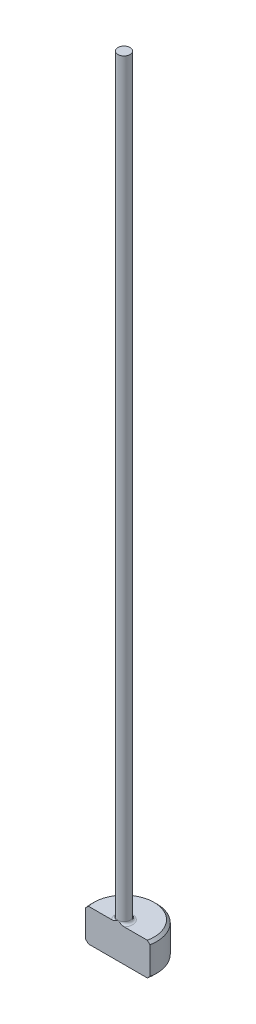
ISO-10303-21;
HEADER;
FILE_DESCRIPTION(('STEP AP214'),'2;1');
FILE_NAME('part.step','',(''),(''),'','','');
FILE_SCHEMA(('AUTOMOTIVE_DESIGN { 1 0 10303 214 1 1 1 1 }'));
ENDSEC;
DATA;
#1=APPLICATION_CONTEXT('core data for automotive mechanical design processes');
#2=APPLICATION_PROTOCOL_DEFINITION('international standard','automotive_design',2000,#1);
#3=PRODUCT_CONTEXT('',#1,'mechanical');
#4=PRODUCT('Part','Part','',(#3));
#5=PRODUCT_RELATED_PRODUCT_CATEGORY('part','',(#4));
#6=PRODUCT_DEFINITION_FORMATION('','',#4);
#7=PRODUCT_DEFINITION_CONTEXT('part definition',#1,'design');
#8=PRODUCT_DEFINITION('design','',#6,#7);
#9=PRODUCT_DEFINITION_SHAPE('','',#8);
#10=(LENGTH_UNIT() NAMED_UNIT(*) SI_UNIT(.MILLI.,.METRE.));
#11=(NAMED_UNIT(*) PLANE_ANGLE_UNIT() SI_UNIT($,.RADIAN.));
#12=(NAMED_UNIT(*) SI_UNIT($,.STERADIAN.) SOLID_ANGLE_UNIT());
#13=UNCERTAINTY_MEASURE_WITH_UNIT(LENGTH_MEASURE(1.E-05),#10,'distance_accuracy_value','');
#14=(GEOMETRIC_REPRESENTATION_CONTEXT(3) GLOBAL_UNCERTAINTY_ASSIGNED_CONTEXT((#13)) GLOBAL_UNIT_ASSIGNED_CONTEXT((#10,
#11,#12)) REPRESENTATION_CONTEXT('',''));
#15=CARTESIAN_POINT('',(0.,0.,0.));
#16=DIRECTION('',(0.,0.,1.));
#17=DIRECTION('',(1.,0.,0.));
#18=AXIS2_PLACEMENT_3D('',#15,#16,#17);
#19=CARTESIAN_POINT('',(0.,0.,0.));
#20=DIRECTION('',(0.,-1.,0.));
#21=DIRECTION('',(0.,0.,-1.));
#22=AXIS2_PLACEMENT_3D('',#19,#20,#21);
#23=PLANE('',#22);
#24=CARTESIAN_POINT('',(0.,0.,0.));
#25=DIRECTION('',(0.,-1.,0.));
#26=DIRECTION('',(0.,0.,-1.));
#27=AXIS2_PLACEMENT_3D('',#24,#25,#26);
#28=CIRCLE('',#27,2.92099999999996);
#29=CARTESIAN_POINT('',(-2.85989111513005,0.,0.594359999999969));
#30=VERTEX_POINT('',#29);
#31=CARTESIAN_POINT('',(2.85989111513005,0.,0.594359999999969));
#32=VERTEX_POINT('',#31);
#33=EDGE_CURVE('E98',#30,#32,#28,.T.);
#34=ORIENTED_EDGE('',*,*,#33,.T.);
#35=DIRECTION('',(-1.,0.,0.));
#36=VECTOR('',#35,1.);
#37=CARTESIAN_POINT('',(-3.11887178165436,0.,0.594359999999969));
#38=LINE('',#37,#36);
#39=EDGE_CURVE('E83',#32,#30,#38,.T.);
#40=ORIENTED_EDGE('',*,*,#39,.T.);
#41=EDGE_LOOP('',(#34,#40));
#42=FACE_BOUND('',#41,.T.);
#43=ADVANCED_FACE('F32',(#42),#23,.T.);
#44=CARTESIAN_POINT('',(0.,259.958771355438,0.));
#45=DIRECTION('',(0.,1.,0.));
#46=DIRECTION('',(0.,0.,1.));
#47=AXIS2_PLACEMENT_3D('',#44,#45,#46);
#48=CYLINDRICAL_SURFACE('',#47,3.17499999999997);
#49=CARTESIAN_POINT('',(0.,2.92099999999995,0.));
#50=DIRECTION('',(0.,1.,0.));
#51=DIRECTION('',(0.,0.,1.));
#52=AXIS2_PLACEMENT_3D('',#49,#50,#51);
#53=CIRCLE('',#52,3.17499999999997);
#54=CARTESIAN_POINT('',(-3.11887178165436,2.92099999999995,0.594359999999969));
#55=VERTEX_POINT('',#54);
#56=CARTESIAN_POINT('',(3.11887178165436,2.92099999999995,0.594359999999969));
#57=VERTEX_POINT('',#56);
#58=EDGE_CURVE('E104',#55,#57,#53,.F.);
#59=ORIENTED_EDGE('',*,*,#58,.T.);
#60=DIRECTION('',(0.,-1.,0.));
#61=VECTOR('',#60,1.);
#62=CARTESIAN_POINT('',(3.11887178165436,76.2,0.594359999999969));
#63=LINE('',#62,#61);
#64=CARTESIAN_POINT('',(3.11887178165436,0.254000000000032,0.594359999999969));
#65=VERTEX_POINT('',#64);
#66=EDGE_CURVE('E183',#57,#65,#63,.T.);
#67=ORIENTED_EDGE('',*,*,#66,.T.);
#68=CARTESIAN_POINT('',(0.,0.254000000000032,0.));
#69=DIRECTION('',(0.,-1.,0.));
#70=DIRECTION('',(0.,0.,-1.));
#71=AXIS2_PLACEMENT_3D('',#68,#69,#70);
#72=CIRCLE('',#71,3.17499999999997);
#73=CARTESIAN_POINT('',(-3.11887178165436,0.254000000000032,0.594359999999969));
#74=VERTEX_POINT('',#73);
#75=EDGE_CURVE('E100',#65,#74,#72,.F.);
#76=ORIENTED_EDGE('',*,*,#75,.T.);
#77=DIRECTION('',(0.,-1.,0.));
#78=VECTOR('',#77,1.);
#79=CARTESIAN_POINT('',(-3.11887178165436,76.2,0.594359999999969));
#80=LINE('',#79,#78);
#81=EDGE_CURVE('E93',#55,#74,#80,.T.);
#82=ORIENTED_EDGE('',*,*,#81,.F.);
#83=EDGE_LOOP('',(#59,#67,#76,#82));
#84=FACE_BOUND('',#83,.T.);
#85=ADVANCED_FACE('F158',(#84),#48,.T.);
#86=CARTESIAN_POINT('',(-3.17499999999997,3.175,0.));
#87=DIRECTION('',(0.,1.,0.));
#88=DIRECTION('',(0.,0.,1.));
#89=AXIS2_PLACEMENT_3D('',#86,#87,#88);
#90=PLANE('',#89);
#91=CARTESIAN_POINT('',(0.,3.175,0.));
#92=DIRECTION('',(0.,1.,0.));
#93=DIRECTION('',(0.,0.,1.));
#94=AXIS2_PLACEMENT_3D('',#91,#92,#93);
#95=CIRCLE('',#94,2.92099999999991);
#96=CARTESIAN_POINT('',(2.85989111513,3.175,0.594359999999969));
#97=VERTEX_POINT('',#96);
#98=CARTESIAN_POINT('',(-2.85989111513,3.175,0.594359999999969));
#99=VERTEX_POINT('',#98);
#100=EDGE_CURVE('E178',#97,#99,#95,.T.);
#101=ORIENTED_EDGE('',*,*,#100,.T.);
#102=DIRECTION('',(1.,0.,0.));
#103=VECTOR('',#102,1.);
#104=CARTESIAN_POINT('',(-3.17499999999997,3.175,0.594359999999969));
#105=LINE('',#104,#103);
#106=CARTESIAN_POINT('',(-0.605351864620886,3.17500000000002,0.594359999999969));
#107=VERTEX_POINT('',#106);
#108=EDGE_CURVE('E57',#99,#107,#105,.T.);
#109=ORIENTED_EDGE('',*,*,#108,.T.);
#110=CARTESIAN_POINT('',(0.,3.175,0.));
#111=DIRECTION('',(0.,1.,0.));
#112=DIRECTION('',(0.,0.,1.));
#113=AXIS2_PLACEMENT_3D('',#110,#111,#112);
#114=CIRCLE('',#113,0.848359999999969);
#115=CARTESIAN_POINT('',(0.605351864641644,3.17500000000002,0.594359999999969));
#116=VERTEX_POINT('',#115);
#117=EDGE_CURVE('E107',#107,#116,#114,.F.);
#118=ORIENTED_EDGE('',*,*,#117,.T.);
#119=EDGE_CURVE('E136',#116,#97,#105,.T.);
#120=ORIENTED_EDGE('',*,*,#119,.T.);
#121=EDGE_LOOP('',(#101,#109,#118,#120));
#122=FACE_BOUND('',#121,.T.);
#123=ADVANCED_FACE('F147',(#122),#90,.T.);
#124=CARTESIAN_POINT('',(0.,3.17499999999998,0.));
#125=DIRECTION('',(0.,-1.,0.));
#126=DIRECTION('',(0.,0.,-1.));
#127=AXIS2_PLACEMENT_3D('',#124,#125,#126);
#128=CONICAL_SURFACE('',#127,2.92099999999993,0.78539816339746);
#129=ORIENTED_EDGE('',*,*,#58,.F.);
#130=CARTESIAN_POINT('',(-6.8648194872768,-0.794501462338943,0.594359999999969));
#131=CARTESIAN_POINT('',(-6.61917114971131,-0.549776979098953,0.594359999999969));
#132=CARTESIAN_POINT('',(-6.37348172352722,-0.305093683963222,0.594359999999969));
#133=CARTESIAN_POINT('',(-5.88194851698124,0.184148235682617,0.594359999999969));
#134=CARTESIAN_POINT('',(-5.63610472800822,0.428706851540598,0.594359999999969));
#135=CARTESIAN_POINT('',(-5.14385611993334,0.917989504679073,0.594359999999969));
#136=CARTESIAN_POINT('',(-4.89745100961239,1.16271324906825,0.594359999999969));
#137=CARTESIAN_POINT('',(-4.40434968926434,1.65183765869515,0.594359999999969));
#138=CARTESIAN_POINT('',(-4.15765349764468,1.89623834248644,0.594359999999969));
#139=CARTESIAN_POINT('',(-3.67893599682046,2.36952748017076,0.594359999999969));
#140=CARTESIAN_POINT('',(-3.44694459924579,2.59844615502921,0.594359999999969));
#141=CARTESIAN_POINT('',(-3.09833846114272,2.9412371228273,0.594359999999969));
#142=CARTESIAN_POINT('',(-2.98202264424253,3.05541328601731,0.594359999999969));
#143=CARTESIAN_POINT('',(-2.74910931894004,3.28347396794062,0.594359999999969));
#144=CARTESIAN_POINT('',(-2.6325118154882,3.39735849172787,0.594359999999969));
#145=CARTESIAN_POINT('',(-2.399009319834,3.62460667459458,0.594359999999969));
#146=CARTESIAN_POINT('',(-2.28210468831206,3.73797070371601,0.594359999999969));
#147=CARTESIAN_POINT('',(-2.0476569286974,3.96405258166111,0.594359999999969));
#148=CARTESIAN_POINT('',(-1.93011375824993,4.07677038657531,0.594359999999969));
#149=CARTESIAN_POINT('',(-1.69404304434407,4.30110221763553,0.594359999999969));
#150=CARTESIAN_POINT('',(-1.57551582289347,4.412716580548,0.594359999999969));
#151=CARTESIAN_POINT('',(-1.39631926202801,4.578608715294,0.594359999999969));
#152=CARTESIAN_POINT('',(-1.33635609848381,4.63364822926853,0.594359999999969));
#153=CARTESIAN_POINT('',(-1.2157533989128,4.74298001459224,0.594359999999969));
#154=CARTESIAN_POINT('',(-1.1551138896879,4.79727231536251,0.594359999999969));
#155=CARTESIAN_POINT('',(-1.05978852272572,4.88102982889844,0.594359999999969));
#156=CARTESIAN_POINT('',(-1.02544763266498,4.91088723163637,0.594359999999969));
#157=CARTESIAN_POINT('',(-0.95635921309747,4.97013600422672,0.594359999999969));
#158=CARTESIAN_POINT('',(-0.921611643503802,4.99952732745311,0.594359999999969));
#159=CARTESIAN_POINT('',(-0.851219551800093,5.05799717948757,0.594359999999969));
#160=CARTESIAN_POINT('',(-0.815569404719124,5.08706896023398,0.594359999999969));
#161=CARTESIAN_POINT('',(-0.74357323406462,5.14432373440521,0.594359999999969));
#162=CARTESIAN_POINT('',(-0.707227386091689,5.17250694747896,0.594359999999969));
#163=CARTESIAN_POINT('',(-0.633142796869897,5.22794418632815,0.594359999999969));
#164=CARTESIAN_POINT('',(-0.595392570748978,5.25518299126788,0.594359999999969));
#165=CARTESIAN_POINT('',(-0.518500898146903,5.30776394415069,0.594359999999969));
#166=CARTESIAN_POINT('',(-0.479357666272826,5.33310351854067,0.594359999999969));
#167=CARTESIAN_POINT('',(-0.399651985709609,5.38048073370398,0.594359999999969));
#168=CARTESIAN_POINT('',(-0.35910944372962,5.40255109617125,0.594359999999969));
#169=CARTESIAN_POINT('',(-0.275782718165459,5.44180529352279,0.594359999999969));
#170=CARTESIAN_POINT('',(-0.233006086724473,5.45900447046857,0.594359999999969));
#171=CARTESIAN_POINT('',(-0.148687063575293,5.48450569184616,0.594359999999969));
#172=CARTESIAN_POINT('',(-0.107352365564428,5.49344321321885,0.594359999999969));
#173=CARTESIAN_POINT('',(-0.0447378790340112,5.50032302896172,0.594359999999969));
#174=CARTESIAN_POINT('',(-0.0238027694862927,5.50153223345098,0.594359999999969));
#175=CARTESIAN_POINT('',(0.0180770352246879,5.50173397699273,0.594359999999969));
#176=CARTESIAN_POINT('',(0.0390217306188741,5.50072645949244,0.594359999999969));
#177=CARTESIAN_POINT('',(0.101294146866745,5.49447119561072,0.594359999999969));
#178=CARTESIAN_POINT('',(0.142325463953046,5.48601867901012,0.594359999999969));
#179=CARTESIAN_POINT('',(0.202429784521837,5.46841556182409,0.594359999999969));
#180=CARTESIAN_POINT('',(0.222297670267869,5.46169167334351,0.594359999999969));
#181=CARTESIAN_POINT('',(0.261527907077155,5.44689786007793,0.594359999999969));
#182=CARTESIAN_POINT('',(0.280890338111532,5.43882814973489,0.594359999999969));
#183=CARTESIAN_POINT('',(0.334163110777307,5.41482918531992,0.594359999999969));
#184=CARTESIAN_POINT('',(0.367533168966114,5.39771168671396,0.594359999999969));
#185=CARTESIAN_POINT('',(0.43298635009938,5.36114954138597,0.594359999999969));
#186=CARTESIAN_POINT('',(0.465067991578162,5.3417023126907,0.594359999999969));
#187=CARTESIAN_POINT('',(0.528309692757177,5.30115132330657,0.594359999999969));
#188=CARTESIAN_POINT('',(0.559466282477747,5.28004220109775,0.594359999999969));
#189=CARTESIAN_POINT('',(0.620984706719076,5.23669072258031,0.594359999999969));
#190=CARTESIAN_POINT('',(0.651346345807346,5.21444809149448,0.594359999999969));
#191=CARTESIAN_POINT('',(0.742070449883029,5.14609257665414,0.594359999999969));
#192=CARTESIAN_POINT('',(0.801494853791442,5.09874004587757,0.594359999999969));
#193=CARTESIAN_POINT('',(0.918675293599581,5.00231746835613,0.594359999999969));
#194=CARTESIAN_POINT('',(0.976434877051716,4.95325165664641,0.594359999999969));
#195=CARTESIAN_POINT('',(1.08971968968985,4.85504334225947,0.594359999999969));
#196=CARTESIAN_POINT('',(1.14526623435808,4.80592537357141,0.594359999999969));
#197=CARTESIAN_POINT('',(1.2556992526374,4.70695340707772,0.594359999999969));
#198=CARTESIAN_POINT('',(1.31058570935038,4.65709939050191,0.594359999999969));
#199=CARTESIAN_POINT('',(1.47456346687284,4.50676433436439,0.594359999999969));
#200=CARTESIAN_POINT('',(1.58295757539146,4.4055240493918,0.594359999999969));
#201=CARTESIAN_POINT('',(1.79884367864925,4.2018371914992,0.594359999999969));
#202=CARTESIAN_POINT('',(1.90633444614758,4.09938932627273,0.594359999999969));
#203=CARTESIAN_POINT('',(2.12066278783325,3.89382966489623,0.594359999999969));
#204=CARTESIAN_POINT('',(2.22750041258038,3.79071792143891,0.594359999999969));
#205=CARTESIAN_POINT('',(2.43977439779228,3.58500662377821,0.594359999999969));
#206=CARTESIAN_POINT('',(2.54521462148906,3.48241104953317,0.594359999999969));
#207=CARTESIAN_POINT('',(2.75580702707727,3.27692056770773,0.594359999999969));
#208=CARTESIAN_POINT('',(2.86095920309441,3.17402565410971,0.594359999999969));
#209=CARTESIAN_POINT('',(3.17601133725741,2.86511932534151,0.594359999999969));
#210=CARTESIAN_POINT('',(3.38560260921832,2.6587932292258,0.594359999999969));
#211=CARTESIAN_POINT('',(3.86691725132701,2.18392087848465,0.594359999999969));
#212=CARTESIAN_POINT('',(4.13848251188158,1.91521456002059,0.594359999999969));
#213=CARTESIAN_POINT('',(4.681229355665,1.37732631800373,0.594359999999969));
#214=CARTESIAN_POINT('',(4.95241086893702,1.10814432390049,0.594359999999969));
#215=CARTESIAN_POINT('',(5.497253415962,0.566796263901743,0.594359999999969));
#216=CARTESIAN_POINT('',(5.77091180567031,0.294627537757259,0.594359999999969));
#217=CARTESIAN_POINT('',(6.31800243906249,-0.249845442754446,0.594359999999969));
#218=CARTESIAN_POINT('',(6.59143471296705,-0.522149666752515,0.594359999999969));
#219=CARTESIAN_POINT('',(6.8648194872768,-0.794501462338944,0.594359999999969));
#220=B_SPLINE_CURVE_WITH_KNOTS('',3,(#130,#131,#132,#133,#134,#135,#136,#137,#138,#139,#140,
#141,#142,#143,#144,#145,#146,#147,#148,#149,#150,#151,#152,#153,#154,#155,#156,#157,#158,#159,
#160,#161,#162,#163,#164,#165,#166,#167,#168,#169,#170,#171,#172,#173,#174,#175,#176,#177,#178,
#179,#180,#181,#182,#183,#184,#185,#186,#187,#188,#189,#190,#191,#192,#193,#194,#195,#196,#197,
#198,#199,#200,#201,#202,#203,#204,#205,#206,#207,#208,#209,#210,#211,#212,#213,#214,#215,#216,
#217,#218,#219),.UNSPECIFIED.,.F.,.F.,(4,2,2,2,2,2,2,2,2,2,2,2,2,2,2,2,2,2,2,2,2,2,2,2,2,2,2,2,
2,2,2,2,2,2,2,2,2,2,2,2,2,2,2,2,4),(0.,1.04023973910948,2.08054385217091,3.12239139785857,
4.16417625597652,5.141934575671,5.63090260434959,6.11986210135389,6.60839150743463,
7.0969537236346,7.58536191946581,7.82953936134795,8.07370716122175,8.21022095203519,
8.3467483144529,8.48474175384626,8.62270081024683,8.76231642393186,8.90211792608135,
9.0404087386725,9.17825902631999,9.3043114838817,9.3671106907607,9.42991149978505,
9.55472897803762,9.61762313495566,9.68050727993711,9.79286939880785,9.9053572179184,
10.0182241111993,10.1311184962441,10.3589904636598,10.5863342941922,10.8087690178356,
11.0312094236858,11.4761525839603,11.9216253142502,12.36706311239,12.8084142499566,
13.2497743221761,14.1320939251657,15.2781982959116,16.4244899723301,17.5823683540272,
18.7400526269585),.UNSPECIFIED.);
#221=EDGE_CURVE('E135',#55,#99,#220,.T.);
#222=ORIENTED_EDGE('',*,*,#221,.T.);
#223=ORIENTED_EDGE('',*,*,#100,.F.);
#224=EDGE_CURVE('E127',#97,#57,#220,.T.);
#225=ORIENTED_EDGE('',*,*,#224,.T.);
#226=EDGE_LOOP('',(#129,#222,#223,#225));
#227=FACE_BOUND('',#226,.T.);
#228=ADVANCED_FACE('F143',(#227),#128,.T.);
#229=CARTESIAN_POINT('',(0.,0.254000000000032,0.));
#230=DIRECTION('',(0.,1.,0.));
#231=DIRECTION('',(0.,0.,1.));
#232=AXIS2_PLACEMENT_3D('',#229,#230,#231);
#233=CONICAL_SURFACE('',#232,3.17499999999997,0.785398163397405);
#234=ORIENTED_EDGE('',*,*,#75,.F.);
#235=CARTESIAN_POINT('',(6.8648194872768,3.96950146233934,0.594359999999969));
#236=CARTESIAN_POINT('',(6.61917114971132,3.72477697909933,0.594359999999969));
#237=CARTESIAN_POINT('',(6.37348172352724,3.48009368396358,0.594359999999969));
#238=CARTESIAN_POINT('',(5.88194851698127,2.9908517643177,0.594359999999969));
#239=CARTESIAN_POINT('',(5.63610472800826,2.74629314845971,0.594359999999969));
#240=CARTESIAN_POINT('',(5.1438561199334,2.25701049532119,0.594359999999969));
#241=CARTESIAN_POINT('',(4.89745100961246,2.012286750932,0.594359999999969));
#242=CARTESIAN_POINT('',(4.40434968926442,1.52316234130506,0.594359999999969));
#243=CARTESIAN_POINT('',(4.15765349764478,1.27876165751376,0.594359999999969));
#244=CARTESIAN_POINT('',(3.67893599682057,0.805472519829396,0.594359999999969));
#245=CARTESIAN_POINT('',(3.44694459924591,0.576553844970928,0.594359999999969));
#246=CARTESIAN_POINT('',(3.09833846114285,0.23376287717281,0.594359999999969));
#247=CARTESIAN_POINT('',(2.98202264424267,0.119586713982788,0.594359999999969));
#248=CARTESIAN_POINT('',(2.74910931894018,-0.108473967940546,0.594359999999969));
#249=CARTESIAN_POINT('',(2.63251181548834,-0.222358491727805,0.594359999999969));
#250=CARTESIAN_POINT('',(2.39900931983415,-0.449606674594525,0.594359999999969));
#251=CARTESIAN_POINT('',(2.28210468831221,-0.562970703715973,0.594359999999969));
#252=CARTESIAN_POINT('',(2.04765692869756,-0.789052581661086,0.594359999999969));
#253=CARTESIAN_POINT('',(1.93011375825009,-0.901770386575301,0.594359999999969));
#254=CARTESIAN_POINT('',(1.69404304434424,-1.12610221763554,0.594359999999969));
#255=CARTESIAN_POINT('',(1.57551582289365,-1.23771658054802,0.594359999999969));
#256=CARTESIAN_POINT('',(1.39631926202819,-1.40360871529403,0.594359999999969));
#257=CARTESIAN_POINT('',(1.33635609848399,-1.45864822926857,0.594359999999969));
#258=CARTESIAN_POINT('',(1.21575339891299,-1.56798001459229,0.594359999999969));
#259=CARTESIAN_POINT('',(1.15511388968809,-1.62227231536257,0.594359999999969));
#260=CARTESIAN_POINT('',(1.05978852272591,-1.70602982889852,0.594359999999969));
#261=CARTESIAN_POINT('',(1.02544763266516,-1.73588723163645,0.594359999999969));
#262=CARTESIAN_POINT('',(0.956359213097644,-1.79513600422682,0.594359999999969));
#263=CARTESIAN_POINT('',(0.921611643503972,-1.82452732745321,0.594359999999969));
#264=CARTESIAN_POINT('',(0.851219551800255,-1.8829971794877,0.594359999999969));
#265=CARTESIAN_POINT('',(0.815569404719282,-1.91206896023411,0.594359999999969));
#266=CARTESIAN_POINT('',(0.743573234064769,-1.96932373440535,0.594359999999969));
#267=CARTESIAN_POINT('',(0.707227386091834,-1.99750694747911,0.594359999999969));
#268=CARTESIAN_POINT('',(0.633142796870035,-2.05294418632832,0.594359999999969));
#269=CARTESIAN_POINT('',(0.595392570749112,-2.08018299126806,0.594359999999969));
#270=CARTESIAN_POINT('',(0.518500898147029,-2.13276394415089,0.594359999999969));
#271=CARTESIAN_POINT('',(0.479357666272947,-2.15810351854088,0.594359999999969));
#272=CARTESIAN_POINT('',(0.399651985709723,-2.20548073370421,0.594359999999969));
#273=CARTESIAN_POINT('',(0.359109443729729,-2.22755109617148,0.594359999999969));
#274=CARTESIAN_POINT('',(0.275782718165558,-2.26680529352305,0.594359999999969));
#275=CARTESIAN_POINT('',(0.233006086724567,-2.28400447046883,0.594359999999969));
#276=CARTESIAN_POINT('',(0.148687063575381,-2.30950569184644,0.594359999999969));
#277=CARTESIAN_POINT('',(0.107352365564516,-2.31844321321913,0.594359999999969));
#278=CARTESIAN_POINT('',(0.0447378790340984,-2.32532302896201,0.594359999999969));
#279=CARTESIAN_POINT('',(0.0238027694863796,-2.32653223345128,0.594359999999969));
#280=CARTESIAN_POINT('',(-0.0180770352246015,-2.32673397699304,0.594359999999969));
#281=CARTESIAN_POINT('',(-0.0390217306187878,-2.32572645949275,0.594359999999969));
#282=CARTESIAN_POINT('',(-0.101294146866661,-2.31947119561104,0.594359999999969));
#283=CARTESIAN_POINT('',(-0.142325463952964,-2.31101867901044,0.594359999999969));
#284=CARTESIAN_POINT('',(-0.202429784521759,-2.29341556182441,0.594359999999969));
#285=CARTESIAN_POINT('',(-0.222297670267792,-2.28669167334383,0.594359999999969));
#286=CARTESIAN_POINT('',(-0.261527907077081,-2.27189786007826,0.594359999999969));
#287=CARTESIAN_POINT('',(-0.280890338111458,-2.26382814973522,0.594359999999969));
#288=CARTESIAN_POINT('',(-0.334163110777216,-2.23982918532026,0.594359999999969));
#289=CARTESIAN_POINT('',(-0.367533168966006,-2.22271168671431,0.594359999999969));
#290=CARTESIAN_POINT('',(-0.432986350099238,-2.18614954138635,0.594359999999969));
#291=CARTESIAN_POINT('',(-0.465067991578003,-2.16670231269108,0.594359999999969));
#292=CARTESIAN_POINT('',(-0.528309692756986,-2.12615132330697,0.594359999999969));
#293=CARTESIAN_POINT('',(-0.55946628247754,-2.10504220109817,0.594359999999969));
#294=CARTESIAN_POINT('',(-0.620984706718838,-2.06169072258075,0.594359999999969));
#295=CARTESIAN_POINT('',(-0.651346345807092,-2.03944809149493,0.594359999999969));
#296=CARTESIAN_POINT('',(-0.742070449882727,-1.97109257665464,0.594359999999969));
#297=CARTESIAN_POINT('',(-0.801494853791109,-1.92374004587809,0.594359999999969));
#298=CARTESIAN_POINT('',(-0.918675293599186,-1.82731746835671,0.594359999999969));
#299=CARTESIAN_POINT('',(-0.97643487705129,-1.77825165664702,0.594359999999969));
#300=CARTESIAN_POINT('',(-1.08971968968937,-1.68004334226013,0.594359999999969));
#301=CARTESIAN_POINT('',(-1.14526623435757,-1.6309253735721,0.594359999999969));
#302=CARTESIAN_POINT('',(-1.25569925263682,-1.53195340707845,0.594359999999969));
#303=CARTESIAN_POINT('',(-1.31058570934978,-1.48209939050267,0.594359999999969));
#304=CARTESIAN_POINT('',(-1.47456346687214,-1.33176433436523,0.594359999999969));
#305=CARTESIAN_POINT('',(-1.5829575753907,-1.23052404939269,0.594359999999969));
#306=CARTESIAN_POINT('',(-1.79884367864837,-1.0268371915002,0.594359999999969));
#307=CARTESIAN_POINT('',(-1.90633444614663,-0.924389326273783,0.594359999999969));
#308=CARTESIAN_POINT('',(-2.12066278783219,-0.718829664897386,0.594359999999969));
#309=CARTESIAN_POINT('',(-2.22750041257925,-0.615717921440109,0.594359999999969));
#310=CARTESIAN_POINT('',(-2.43977439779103,-0.410006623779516,0.594359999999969));
#311=CARTESIAN_POINT('',(-2.54521462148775,-0.307411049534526,0.594359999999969));
#312=CARTESIAN_POINT('',(-2.75580702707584,-0.101920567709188,0.594359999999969));
#313=CARTESIAN_POINT('',(-2.86095920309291,0.000974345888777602,0.594359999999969));
#314=CARTESIAN_POINT('',(-3.17601133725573,0.309880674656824,0.594359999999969));
#315=CARTESIAN_POINT('',(-3.38560260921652,0.516206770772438,0.594359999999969));
#316=CARTESIAN_POINT('',(-3.86691725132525,0.991079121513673,0.594359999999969));
#317=CARTESIAN_POINT('',(-4.13848251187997,1.25978543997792,0.594359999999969));
#318=CARTESIAN_POINT('',(-4.68122935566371,1.79767368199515,0.594359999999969));
#319=CARTESIAN_POINT('',(-4.95241086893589,2.06685567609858,0.594359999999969));
#320=CARTESIAN_POINT('',(-5.49725341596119,2.6082037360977,0.594359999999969));
#321=CARTESIAN_POINT('',(-5.77091180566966,2.88037246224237,0.594359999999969));
#322=CARTESIAN_POINT('',(-6.31800243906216,3.42484544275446,0.594359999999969));
#323=CARTESIAN_POINT('',(-6.59143471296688,3.69714966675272,0.594359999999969));
#324=CARTESIAN_POINT('',(-6.8648194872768,3.96950146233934,0.594359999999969));
#325=B_SPLINE_CURVE_WITH_KNOTS('',3,(#235,#236,#237,#238,#239,#240,#241,#242,#243,#244,#245,
#246,#247,#248,#249,#250,#251,#252,#253,#254,#255,#256,#257,#258,#259,#260,#261,#262,#263,#264,
#265,#266,#267,#268,#269,#270,#271,#272,#273,#274,#275,#276,#277,#278,#279,#280,#281,#282,#283,
#284,#285,#286,#287,#288,#289,#290,#291,#292,#293,#294,#295,#296,#297,#298,#299,#300,#301,#302,
#303,#304,#305,#306,#307,#308,#309,#310,#311,#312,#313,#314,#315,#316,#317,#318,#319,#320,#321,
#322,#323,#324),.UNSPECIFIED.,.F.,.F.,(4,2,2,2,2,2,2,2,2,2,2,2,2,2,2,2,2,2,2,2,2,2,2,2,2,2,2,2,
2,2,2,2,2,2,2,2,2,2,2,2,2,2,2,2,4),(0.,1.0402397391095,2.08054385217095,3.12239139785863,
4.16417625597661,5.1419345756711,5.63090260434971,6.11986210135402,6.60839150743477,
7.09695372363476,7.58536191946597,7.82953936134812,8.07370716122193,8.2102209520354,
8.34674831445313,8.48474175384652,8.62270081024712,8.76231642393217,8.90211792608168,
9.04040873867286,9.17825902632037,9.30431148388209,9.36711069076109,9.42991149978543,
9.55472897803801,9.61762313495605,9.68050727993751,9.79286939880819,9.90535721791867,
10.0182241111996,10.1311184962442,10.3589904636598,10.5863342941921,10.8087690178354,
11.0312094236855,11.4761525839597,11.9216253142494,12.367063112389,12.8084142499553,
13.2497743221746,14.1320939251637,15.2781982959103,16.4244899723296,17.5823683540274,
18.7400526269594),.UNSPECIFIED.);
#326=EDGE_CURVE('E86',#65,#32,#325,.T.);
#327=ORIENTED_EDGE('',*,*,#326,.T.);
#328=ORIENTED_EDGE('',*,*,#33,.F.);
#329=EDGE_CURVE('E89',#30,#74,#325,.T.);
#330=ORIENTED_EDGE('',*,*,#329,.T.);
#331=EDGE_LOOP('',(#234,#327,#328,#330));
#332=FACE_BOUND('',#331,.T.);
#333=ADVANCED_FACE('F97',(#332),#233,.T.);
#334=CARTESIAN_POINT('',(0.,3.42900000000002,0.));
#335=DIRECTION('',(0.,1.,0.));
#336=DIRECTION('',(0.,0.,1.));
#337=AXIS2_PLACEMENT_3D('',#334,#335,#336);
#338=TOROIDAL_SURFACE('',#337,0.848359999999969,0.254);
#339=CARTESIAN_POINT('',(0.,3.42900000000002,0.594359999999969));
#340=CARTESIAN_POINT('',(1.36452584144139E-10,3.42900060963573,0.594359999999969));
#341=CARTESIAN_POINT('',(6.87113851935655E-08,3.42900121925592,0.594359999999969));
#342=CARTESIAN_POINT('',(3.08798582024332E-07,3.42900241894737,0.594359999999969));
#343=CARTESIAN_POINT('',(4.80878843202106E-07,3.42900300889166,0.594359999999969));
#344=CARTESIAN_POINT('',(9.06047528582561E-07,3.42900417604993,0.594359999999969));
#345=CARTESIAN_POINT('',(1.16117831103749E-06,3.42900475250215,0.594359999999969));
#346=CARTESIAN_POINT('',(1.73122080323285E-06,3.42900587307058,0.594359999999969));
#347=CARTESIAN_POINT('',(2.04604621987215E-06,3.42900641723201,0.594359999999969));
#348=CARTESIAN_POINT('',(3.12035972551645E-06,3.42900811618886,0.594359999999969));
#349=CARTESIAN_POINT('',(3.96023571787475E-06,3.42900922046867,0.594359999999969));
#350=CARTESIAN_POINT('',(5.76398603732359E-06,3.4290112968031,0.594359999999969));
#351=CARTESIAN_POINT('',(6.72655427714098E-06,3.42901227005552,0.594359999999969));
#352=CARTESIAN_POINT('',(1.0205483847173E-05,3.42901557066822,0.594359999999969));
#353=CARTESIAN_POINT('',(1.28810248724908E-05,3.42901773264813,0.594359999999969));
#354=CARTESIAN_POINT('',(1.8380850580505E-05,3.42902157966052,0.594359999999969));
#355=CARTESIAN_POINT('',(2.11946408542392E-05,3.42902328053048,0.594359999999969));
#356=CARTESIAN_POINT('',(3.22646354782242E-05,3.42902979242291,0.594359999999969));
#357=CARTESIAN_POINT('',(4.06655811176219E-05,3.42903434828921,0.594359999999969));
#358=CARTESIAN_POINT('',(5.69174548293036E-05,3.42904231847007,0.594359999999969));
#359=CARTESIAN_POINT('',(6.47335102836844E-05,3.42904580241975,0.594359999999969));
#360=CARTESIAN_POINT('',(0.000116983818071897,3.42907110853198,0.594359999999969));
#361=CARTESIAN_POINT('',(0.000157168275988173,3.42910070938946,0.594359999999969));
#362=CARTESIAN_POINT('',(0.000307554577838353,3.42920674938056,0.594359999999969));
#363=CARTESIAN_POINT('',(0.00042079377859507,3.42927738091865,0.594359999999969));
#364=CARTESIAN_POINT('',(0.000839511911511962,3.42954315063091,0.594359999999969));
#365=CARTESIAN_POINT('',(0.00114189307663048,3.4297442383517,0.594359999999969));
#366=CARTESIAN_POINT('',(0.00232105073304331,3.43052379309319,0.594359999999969));
#367=CARTESIAN_POINT('',(0.00320118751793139,3.43109578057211,0.594359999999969));
#368=CARTESIAN_POINT('',(0.0234009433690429,3.44422844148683,0.594359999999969));
#369=CARTESIAN_POINT('',(0.0426795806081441,3.45687033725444,0.594359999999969));
#370=CARTESIAN_POINT('',(0.0808467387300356,3.48151792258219,0.594359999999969));
#371=CARTESIAN_POINT('',(0.0997303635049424,3.49353143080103,0.594359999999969));
#372=CARTESIAN_POINT('',(0.139526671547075,3.51826080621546,0.594359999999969));
#373=CARTESIAN_POINT('',(0.160464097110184,3.53093743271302,0.594359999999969));
#374=CARTESIAN_POINT('',(0.202966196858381,3.55561064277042,0.594359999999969));
#375=CARTESIAN_POINT('',(0.22453456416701,3.56760092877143,0.594359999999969));
#376=CARTESIAN_POINT('',(0.263544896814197,3.58800713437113,0.594359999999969));
#377=CARTESIAN_POINT('',(0.280874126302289,3.59663639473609,0.594359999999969));
#378=CARTESIAN_POINT('',(0.315897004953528,3.61301779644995,0.594359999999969));
#379=CARTESIAN_POINT('',(0.3335898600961,3.62077164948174,0.594359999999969));
#380=CARTESIAN_POINT('',(0.38662767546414,3.64218550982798,0.594359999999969));
#381=CARTESIAN_POINT('',(0.422610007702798,3.65436787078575,0.594359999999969));
#382=CARTESIAN_POINT('',(0.486709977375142,3.67060231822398,0.594359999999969));
#383=CARTESIAN_POINT('',(0.514498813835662,3.67593446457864,0.594359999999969));
#384=CARTESIAN_POINT('',(0.571596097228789,3.68263920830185,0.594359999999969));
#385=CARTESIAN_POINT('',(0.600923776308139,3.68386758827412,0.594359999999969));
#386=CARTESIAN_POINT('',(0.651436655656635,3.68128040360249,0.594359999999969));
#387=CARTESIAN_POINT('',(0.672684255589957,3.6787360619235,0.594359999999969));
#388=CARTESIAN_POINT('',(0.714355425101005,3.67034643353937,0.594359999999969));
#389=CARTESIAN_POINT('',(0.734784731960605,3.66453138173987,0.594359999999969));
#390=CARTESIAN_POINT('',(0.770139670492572,3.65086692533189,0.594359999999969));
#391=CARTESIAN_POINT('',(0.785325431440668,3.64369340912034,0.594359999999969));
#392=CARTESIAN_POINT('',(0.814359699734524,3.62695940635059,0.594359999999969));
#393=CARTESIAN_POINT('',(0.828207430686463,3.61739754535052,0.594359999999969));
#394=CARTESIAN_POINT('',(0.851880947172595,3.5976439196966,0.594359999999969));
#395=CARTESIAN_POINT('',(0.861995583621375,3.58779913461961,0.594359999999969));
#396=CARTESIAN_POINT('',(0.880456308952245,3.56656632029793,0.594359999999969));
#397=CARTESIAN_POINT('',(0.888803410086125,3.55517918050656,0.594359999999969));
#398=CARTESIAN_POINT('',(0.90338493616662,3.53102054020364,0.594359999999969));
#399=CARTESIAN_POINT('',(0.909606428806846,3.51824116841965,0.594359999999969));
#400=CARTESIAN_POINT('',(0.919516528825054,3.49173236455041,0.594359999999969));
#401=CARTESIAN_POINT('',(0.923206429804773,3.47800342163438,0.594359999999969));
#402=CARTESIAN_POINT('',(0.927581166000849,3.45158843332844,0.594359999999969));
#403=CARTESIAN_POINT('',(0.928545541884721,3.43894818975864,0.594359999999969));
#404=CARTESIAN_POINT('',(0.928228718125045,3.41369828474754,0.594359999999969));
#405=CARTESIAN_POINT('',(0.926948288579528,3.40108861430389,0.594359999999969));
#406=CARTESIAN_POINT('',(0.922316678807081,3.37684686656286,0.594359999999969));
#407=CARTESIAN_POINT('',(0.919060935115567,3.36519630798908,0.594359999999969));
#408=CARTESIAN_POINT('',(0.9107109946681,3.34257690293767,0.594359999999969));
#409=CARTESIAN_POINT('',(0.905616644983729,3.33160811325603,0.594359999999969));
#410=CARTESIAN_POINT('',(0.893565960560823,3.31018052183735,0.594359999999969));
#411=CARTESIAN_POINT('',(0.886544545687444,3.29975849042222,0.594359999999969));
#412=CARTESIAN_POINT('',(0.871013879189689,3.28009647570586,0.594359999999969));
#413=CARTESIAN_POINT('',(0.862504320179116,3.27085673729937,0.594359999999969));
#414=CARTESIAN_POINT('',(0.843279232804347,3.25272813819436,0.594359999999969));
#415=CARTESIAN_POINT('',(0.832424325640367,3.24398750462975,0.594359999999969));
#416=CARTESIAN_POINT('',(0.809577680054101,3.22813925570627,0.594359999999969));
#417=CARTESIAN_POINT('',(0.797584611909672,3.221033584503,0.594359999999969));
#418=CARTESIAN_POINT('',(0.767220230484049,3.20562204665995,0.594359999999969));
#419=CARTESIAN_POINT('',(0.748396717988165,3.19820249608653,0.594359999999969));
#420=CARTESIAN_POINT('',(0.709849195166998,3.18654279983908,0.594359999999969));
#421=CARTESIAN_POINT('',(0.690126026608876,3.182299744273,0.594359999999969));
#422=CARTESIAN_POINT('',(0.642991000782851,3.1755984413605,0.594359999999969));
#423=CARTESIAN_POINT('',(0.615407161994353,3.17436184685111,0.594359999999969));
#424=CARTESIAN_POINT('',(0.560055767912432,3.17625180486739,0.594359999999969));
#425=CARTESIAN_POINT('',(0.532291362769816,3.1794419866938,0.594359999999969));
#426=CARTESIAN_POINT('',(0.459632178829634,3.19262014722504,0.594359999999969));
#427=CARTESIAN_POINT('',(0.415300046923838,3.20567419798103,0.594359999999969));
#428=CARTESIAN_POINT('',(0.351889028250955,3.22956882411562,0.594359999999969));
#429=CARTESIAN_POINT('',(0.331782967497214,3.2379671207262,0.594359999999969));
#430=CARTESIAN_POINT('',(0.292195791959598,3.25586509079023,0.594359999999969));
#431=CARTESIAN_POINT('',(0.27271176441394,3.26535820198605,0.594359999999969));
#432=CARTESIAN_POINT('',(0.234326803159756,3.28516655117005,0.594359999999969));
#433=CARTESIAN_POINT('',(0.21542301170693,3.29547635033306,0.594359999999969));
#434=CARTESIAN_POINT('',(0.177623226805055,3.31696076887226,0.594359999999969));
#435=CARTESIAN_POINT('',(0.15873465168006,3.32814838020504,0.594359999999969));
#436=CARTESIAN_POINT('',(0.128027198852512,3.34686280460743,0.594359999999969));
#437=CARTESIAN_POINT('',(0.116122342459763,3.35425008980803,0.594359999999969));
#438=CARTESIAN_POINT('',(0.092495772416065,3.369110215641,0.594359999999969));
#439=CARTESIAN_POINT('',(0.0807733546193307,3.3765819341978,0.594359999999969));
#440=CARTESIAN_POINT('',(0.0583668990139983,3.39097763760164,0.594359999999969));
#441=CARTESIAN_POINT('',(0.0476784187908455,3.39789485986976,0.594359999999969));
#442=CARTESIAN_POINT('',(0.0260275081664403,3.41199960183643,0.594359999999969));
#443=CARTESIAN_POINT('',(0.0150662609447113,3.41918908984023,0.594359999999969));
#444=CARTESIAN_POINT('',(0.00320209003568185,3.42690372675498,0.594359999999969));
#445=CARTESIAN_POINT('',(0.00232278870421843,3.42747509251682,0.594359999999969));
#446=CARTESIAN_POINT('',(0.00114386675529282,3.42825447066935,0.594359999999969));
#447=CARTESIAN_POINT('',(0.00084087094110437,3.4284559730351,0.594359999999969));
#448=CARTESIAN_POINT('',(0.000421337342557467,3.42872225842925,0.594359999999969));
#449=CARTESIAN_POINT('',(0.000307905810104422,3.42879300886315,0.594359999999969));
#450=CARTESIAN_POINT('',(0.00015729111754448,3.42889921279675,0.594359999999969));
#451=CARTESIAN_POINT('',(0.000117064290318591,3.42892884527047,0.594359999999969));
#452=CARTESIAN_POINT('',(6.47604447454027E-05,3.4289541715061,0.594359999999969));
#453=CARTESIAN_POINT('',(5.69396530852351E-05,3.42895765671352,0.594359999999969));
#454=CARTESIAN_POINT('',(4.06780426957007E-05,3.42896563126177,0.594359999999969));
#455=CARTESIAN_POINT('',(3.22721968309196E-05,3.4289701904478,0.594359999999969));
#456=CARTESIAN_POINT('',(2.11966652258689E-05,3.42897670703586,0.594359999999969));
#457=CARTESIAN_POINT('',(1.83819551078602E-05,3.42897840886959,0.594359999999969));
#458=CARTESIAN_POINT('',(1.2880507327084E-05,3.42898225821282,0.594359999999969));
#459=CARTESIAN_POINT('',(1.02042801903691E-05,3.42898442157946,0.594359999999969));
#460=CARTESIAN_POINT('',(6.72475164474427E-06,3.42898772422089,0.594359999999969));
#461=CARTESIAN_POINT('',(5.76209631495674E-06,3.42898869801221,0.594359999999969));
#462=CARTESIAN_POINT('',(3.95828419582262E-06,3.42899077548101,0.594359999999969));
#463=CARTESIAN_POINT('',(3.11843511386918E-06,3.42899188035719,0.594359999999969));
#464=CARTESIAN_POINT('',(2.04428922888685E-06,3.42899358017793,0.594359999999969));
#465=CARTESIAN_POINT('',(1.72953861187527E-06,3.42899412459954,0.594359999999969));
#466=CARTESIAN_POINT('',(1.15968942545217E-06,3.42899524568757,0.594359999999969));
#467=CARTESIAN_POINT('',(9.04677259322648E-07,3.42899582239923,0.594359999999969));
#468=CARTESIAN_POINT('',(4.79798753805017E-07,3.4289969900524,0.594359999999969));
#469=CARTESIAN_POINT('',(3.07887916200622E-07,3.42899758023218,0.594359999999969));
#470=CARTESIAN_POINT('',(6.82046385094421E-08,3.42899878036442,0.594359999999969));
#471=CARTESIAN_POINT('',(-1.36491598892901E-10,3.42899939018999,0.594359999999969));
#472=CARTESIAN_POINT('',(0.,3.42900000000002,0.594359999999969));
#473=B_SPLINE_CURVE_WITH_KNOTS('',3,(#339,#340,#341,#342,#343,#344,#345,#346,#347,#348,#349,
#350,#351,#352,#353,#354,#355,#356,#357,#358,#359,#360,#361,#362,#363,#364,#365,#366,#367,#368,
#369,#370,#371,#372,#373,#374,#375,#376,#377,#378,#379,#380,#381,#382,#383,#384,#385,#386,#387,
#388,#389,#390,#391,#392,#393,#394,#395,#396,#397,#398,#399,#400,#401,#402,#403,#404,#405,#406,
#407,#408,#409,#410,#411,#412,#413,#414,#415,#416,#417,#418,#419,#420,#421,#422,#423,#424,#425,
#426,#427,#428,#429,#430,#431,#432,#433,#434,#435,#436,#437,#438,#439,#440,#441,#442,#443,#444,
#445,#446,#447,#448,#449,#450,#451,#452,#453,#454,#455,#456,#457,#458,#459,#460,#461,#462,#463,
#464,#465,#466,#467,#468,#469,#470,#471,#472),.UNSPECIFIED.,.T.,.F.,(4,2,2,2,2,2,2,2,2,2,2,2,2,
2,2,2,2,2,2,2,2,2,2,2,2,2,2,2,2,2,2,2,2,2,2,2,2,2,2,2,2,2,2,2,2,2,2,2,2,2,2,2,2,2,2,2,2,2,2,2,2,
2,2,2,2,2,4),(0.,1.82718643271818E-06,3.66449241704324E-06,5.55090857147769E-06,
7.43461827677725E-06,1.15779231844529E-05,1.56803217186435E-05,2.59538904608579E-05,
3.5809085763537E-05,6.44603270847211E-05,9.01030928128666E-05,0.000238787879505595,
0.00063992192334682,0.00172844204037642,0.00487829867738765,0.0740268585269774,
0.141170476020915,0.214587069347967,0.288594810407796,0.346649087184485,0.404587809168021,
0.518158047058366,0.602827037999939,0.690441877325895,0.754422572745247,0.81782131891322,
0.868016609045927,0.918240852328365,0.960410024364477,1.00255498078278,1.04495196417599,
1.08732726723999,1.12516373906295,1.16298723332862,1.19911455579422,1.23524488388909,
1.27278950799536,1.31034189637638,1.3519907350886,1.39368884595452,1.45405048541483,
1.51435676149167,1.59673550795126,1.68031068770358,1.81806360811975,1.88342041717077,
1.94840406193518,2.01298641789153,2.07883488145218,2.120865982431,2.16256813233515,
2.20076425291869,2.24008319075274,2.2432299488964,2.24432068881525,2.24472250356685,
2.24487134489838,2.24489700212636,2.24492567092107,2.2449355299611,2.24494580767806,
2.24494991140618,2.24495405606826,2.24495594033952,2.24495782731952,2.24495966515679,
2.24496149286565),.UNSPECIFIED.);
#474=CARTESIAN_POINT('',(0.,3.42900000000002,0.594359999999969));
#475=VERTEX_POINT('',#474);
#476=EDGE_CURVE('E11',#116,#475,#473,.T.);
#477=ORIENTED_EDGE('',*,*,#476,.F.);
#478=ORIENTED_EDGE('',*,*,#117,.F.);
#479=CARTESIAN_POINT('',(0.,3.42900000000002,0.594359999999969));
#480=CARTESIAN_POINT('',(-1.36452552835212E-10,3.4289993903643,0.594359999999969));
#481=CARTESIAN_POINT('',(-6.87113851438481E-08,3.42899878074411,0.594359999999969));
#482=CARTESIAN_POINT('',(-3.0879858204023E-07,3.42899758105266,0.594359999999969));
#483=CARTESIAN_POINT('',(-4.80878843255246E-07,3.42899699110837,0.594359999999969));
#484=CARTESIAN_POINT('',(-9.06047528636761E-07,3.4289958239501,0.594359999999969));
#485=CARTESIAN_POINT('',(-1.16117831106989E-06,3.42899524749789,0.594359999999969));
#486=CARTESIAN_POINT('',(-1.73122080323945E-06,3.42899412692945,0.594359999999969));
#487=CARTESIAN_POINT('',(-2.04604621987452E-06,3.42899358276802,0.594359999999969));
#488=CARTESIAN_POINT('',(-3.12035972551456E-06,3.42899188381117,0.594359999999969));
#489=CARTESIAN_POINT('',(-3.96023571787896E-06,3.42899077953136,0.594359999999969));
#490=CARTESIAN_POINT('',(-5.76398603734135E-06,3.42898870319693,0.594359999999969));
#491=CARTESIAN_POINT('',(-6.7265542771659E-06,3.42898772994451,0.594359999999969));
#492=CARTESIAN_POINT('',(-1.02054838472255E-05,3.42898442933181,0.594359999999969));
#493=CARTESIAN_POINT('',(-1.28810248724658E-05,3.4289822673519,0.594359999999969));
#494=CARTESIAN_POINT('',(-1.83808505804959E-05,3.42897842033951,0.594359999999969));
#495=CARTESIAN_POINT('',(-2.11946408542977E-05,3.42897671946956,0.594359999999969));
#496=CARTESIAN_POINT('',(-3.22646354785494E-05,3.42897020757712,0.594359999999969));
#497=CARTESIAN_POINT('',(-4.06655811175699E-05,3.42896565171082,0.594359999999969));
#498=CARTESIAN_POINT('',(-5.69174548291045E-05,3.42895768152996,0.594359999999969));
#499=CARTESIAN_POINT('',(-6.47335102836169E-05,3.42895419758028,0.594359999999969));
#500=CARTESIAN_POINT('',(-0.000116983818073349,3.42892889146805,0.594359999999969));
#501=CARTESIAN_POINT('',(-0.000157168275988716,3.42889929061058,0.594359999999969));
#502=CARTESIAN_POINT('',(-0.000307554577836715,3.42879325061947,0.594359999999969));
#503=CARTESIAN_POINT('',(-0.000420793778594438,3.42872261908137,0.594359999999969));
#504=CARTESIAN_POINT('',(-0.000839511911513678,3.42845684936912,0.594359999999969));
#505=CARTESIAN_POINT('',(-0.00114189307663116,3.42825576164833,0.594359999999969));
#506=CARTESIAN_POINT('',(-0.00232105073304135,3.42747620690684,0.594359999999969));
#507=CARTESIAN_POINT('',(-0.00320118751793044,3.42690421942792,0.594359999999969));
#508=CARTESIAN_POINT('',(-0.0234009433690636,3.41377155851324,0.594359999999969));
#509=CARTESIAN_POINT('',(-0.0426795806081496,3.4011296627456,0.594359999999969));
#510=CARTESIAN_POINT('',(-0.0808467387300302,3.37648207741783,0.594359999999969));
#511=CARTESIAN_POINT('',(-0.0997303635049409,3.364468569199,0.594359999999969));
#512=CARTESIAN_POINT('',(-0.139526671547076,3.33973919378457,0.594359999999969));
#513=CARTESIAN_POINT('',(-0.160464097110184,3.32706256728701,0.594359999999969));
#514=CARTESIAN_POINT('',(-0.202966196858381,3.30238935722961,0.594359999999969));
#515=CARTESIAN_POINT('',(-0.22453456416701,3.2903990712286,0.594359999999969));
#516=CARTESIAN_POINT('',(-0.263544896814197,3.2699928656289,0.594359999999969));
#517=CARTESIAN_POINT('',(-0.280874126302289,3.26136360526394,0.594359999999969));
#518=CARTESIAN_POINT('',(-0.315897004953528,3.24498220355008,0.594359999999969));
#519=CARTESIAN_POINT('',(-0.3335898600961,3.23722835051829,0.594359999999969));
#520=CARTESIAN_POINT('',(-0.38662767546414,3.21581449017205,0.594359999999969));
#521=CARTESIAN_POINT('',(-0.422610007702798,3.20363212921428,0.594359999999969));
#522=CARTESIAN_POINT('',(-0.486709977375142,3.18739768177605,0.594359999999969));
#523=CARTESIAN_POINT('',(-0.514498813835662,3.18206553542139,0.594359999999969));
#524=CARTESIAN_POINT('',(-0.571596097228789,3.17536079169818,0.594359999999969));
#525=CARTESIAN_POINT('',(-0.600923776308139,3.17413241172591,0.594359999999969));
#526=CARTESIAN_POINT('',(-0.651436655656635,3.17671959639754,0.594359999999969));
#527=CARTESIAN_POINT('',(-0.672684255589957,3.17926393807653,0.594359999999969));
#528=CARTESIAN_POINT('',(-0.714355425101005,3.18765356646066,0.594359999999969));
#529=CARTESIAN_POINT('',(-0.734784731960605,3.19346861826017,0.594359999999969));
#530=CARTESIAN_POINT('',(-0.770139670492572,3.20713307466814,0.594359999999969));
#531=CARTESIAN_POINT('',(-0.785325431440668,3.21430659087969,0.594359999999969));
#532=CARTESIAN_POINT('',(-0.814359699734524,3.23104059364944,0.594359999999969));
#533=CARTESIAN_POINT('',(-0.828207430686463,3.24060245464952,0.594359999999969));
#534=CARTESIAN_POINT('',(-0.851880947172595,3.26035608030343,0.594359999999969));
#535=CARTESIAN_POINT('',(-0.861995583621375,3.27020086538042,0.594359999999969));
#536=CARTESIAN_POINT('',(-0.880456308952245,3.2914336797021,0.594359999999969));
#537=CARTESIAN_POINT('',(-0.888803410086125,3.30282081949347,0.594359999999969));
#538=CARTESIAN_POINT('',(-0.90338493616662,3.32697945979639,0.594359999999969));
#539=CARTESIAN_POINT('',(-0.909606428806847,3.33975883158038,0.594359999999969));
#540=CARTESIAN_POINT('',(-0.919516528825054,3.36626763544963,0.594359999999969));
#541=CARTESIAN_POINT('',(-0.923206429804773,3.37999657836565,0.594359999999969));
#542=CARTESIAN_POINT('',(-0.927581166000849,3.40641156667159,0.594359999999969));
#543=CARTESIAN_POINT('',(-0.928545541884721,3.41905181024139,0.594359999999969));
#544=CARTESIAN_POINT('',(-0.928228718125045,3.44430171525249,0.594359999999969));
#545=CARTESIAN_POINT('',(-0.926948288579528,3.45691138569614,0.594359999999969));
#546=CARTESIAN_POINT('',(-0.922316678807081,3.48115313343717,0.594359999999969));
#547=CARTESIAN_POINT('',(-0.919060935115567,3.49280369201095,0.594359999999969));
#548=CARTESIAN_POINT('',(-0.9107109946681,3.51542309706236,0.594359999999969));
#549=CARTESIAN_POINT('',(-0.905616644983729,3.526391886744,0.594359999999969));
#550=CARTESIAN_POINT('',(-0.893565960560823,3.54781947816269,0.594359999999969));
#551=CARTESIAN_POINT('',(-0.886544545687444,3.55824150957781,0.594359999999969));
#552=CARTESIAN_POINT('',(-0.871013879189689,3.57790352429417,0.594359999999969));
#553=CARTESIAN_POINT('',(-0.862504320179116,3.58714326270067,0.594359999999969));
#554=CARTESIAN_POINT('',(-0.843279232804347,3.60527186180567,0.594359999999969));
#555=CARTESIAN_POINT('',(-0.832424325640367,3.61401249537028,0.594359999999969));
#556=CARTESIAN_POINT('',(-0.809577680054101,3.62986074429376,0.594359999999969));
#557=CARTESIAN_POINT('',(-0.797584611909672,3.63696641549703,0.594359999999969));
#558=CARTESIAN_POINT('',(-0.767220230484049,3.65237795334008,0.594359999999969));
#559=CARTESIAN_POINT('',(-0.748396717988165,3.6597975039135,0.594359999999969));
#560=CARTESIAN_POINT('',(-0.709849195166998,3.67145720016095,0.594359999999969));
#561=CARTESIAN_POINT('',(-0.690126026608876,3.67570025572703,0.594359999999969));
#562=CARTESIAN_POINT('',(-0.642991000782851,3.68240155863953,0.594359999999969));
#563=CARTESIAN_POINT('',(-0.615407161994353,3.68363815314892,0.594359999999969));
#564=CARTESIAN_POINT('',(-0.560055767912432,3.68174819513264,0.594359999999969));
#565=CARTESIAN_POINT('',(-0.532291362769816,3.67855801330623,0.594359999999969));
#566=CARTESIAN_POINT('',(-0.459632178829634,3.66537985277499,0.594359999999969));
#567=CARTESIAN_POINT('',(-0.415300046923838,3.652325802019,0.594359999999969));
#568=CARTESIAN_POINT('',(-0.351889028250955,3.62843117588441,0.594359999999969));
#569=CARTESIAN_POINT('',(-0.331782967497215,3.62003287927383,0.594359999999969));
#570=CARTESIAN_POINT('',(-0.292195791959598,3.6021349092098,0.594359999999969));
#571=CARTESIAN_POINT('',(-0.27271176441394,3.59264179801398,0.594359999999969));
#572=CARTESIAN_POINT('',(-0.234326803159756,3.57283344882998,0.594359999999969));
#573=CARTESIAN_POINT('',(-0.215423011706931,3.56252364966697,0.594359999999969));
#574=CARTESIAN_POINT('',(-0.177623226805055,3.54103923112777,0.594359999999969));
#575=CARTESIAN_POINT('',(-0.158734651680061,3.52985161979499,0.594359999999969));
#576=CARTESIAN_POINT('',(-0.128027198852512,3.5111371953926,0.594359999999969));
#577=CARTESIAN_POINT('',(-0.116122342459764,3.503749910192,0.594359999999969));
#578=CARTESIAN_POINT('',(-0.0924957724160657,3.48888978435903,0.594359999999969));
#579=CARTESIAN_POINT('',(-0.0807733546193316,3.48141806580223,0.594359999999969));
#580=CARTESIAN_POINT('',(-0.0583668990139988,3.46702236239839,0.594359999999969));
#581=CARTESIAN_POINT('',(-0.0476784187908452,3.46010514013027,0.594359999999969));
#582=CARTESIAN_POINT('',(-0.0260275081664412,3.4460003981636,0.594359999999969));
#583=CARTESIAN_POINT('',(-0.0150662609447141,3.4388109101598,0.594359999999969));
#584=CARTESIAN_POINT('',(-0.00320209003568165,3.43109627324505,0.594359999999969));
#585=CARTESIAN_POINT('',(-0.002322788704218,3.43052490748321,0.594359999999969));
#586=CARTESIAN_POINT('',(-0.00114386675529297,3.42974552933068,0.594359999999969));
#587=CARTESIAN_POINT('',(-0.000840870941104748,3.42954402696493,0.594359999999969));
#588=CARTESIAN_POINT('',(-0.000421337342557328,3.42927774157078,0.594359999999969));
#589=CARTESIAN_POINT('',(-0.00030790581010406,3.42920699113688,0.594359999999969));
#590=CARTESIAN_POINT('',(-0.000157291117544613,3.42910078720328,0.594359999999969));
#591=CARTESIAN_POINT('',(-0.000117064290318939,3.42907115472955,0.594359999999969));
#592=CARTESIAN_POINT('',(-6.47604447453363E-05,3.42904582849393,0.594359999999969));
#593=CARTESIAN_POINT('',(-5.69396530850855E-05,3.42904234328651,0.594359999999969));
#594=CARTESIAN_POINT('',(-4.06780426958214E-05,3.42903436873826,0.594359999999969));
#595=CARTESIAN_POINT('',(-3.22721968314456E-05,3.42902980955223,0.594359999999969));
#596=CARTESIAN_POINT('',(-2.11966652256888E-05,3.42902329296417,0.594359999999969));
#597=CARTESIAN_POINT('',(-1.83819551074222E-05,3.42902159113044,0.594359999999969));
#598=CARTESIAN_POINT('',(-1.28805073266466E-05,3.42901774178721,0.594359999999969));
#599=CARTESIAN_POINT('',(-1.02042801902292E-05,3.42901557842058,0.594359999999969));
#600=CARTESIAN_POINT('',(-6.72475164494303E-06,3.42901227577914,0.594359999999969));
#601=CARTESIAN_POINT('',(-5.76209631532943E-06,3.42901130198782,0.594359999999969));
#602=CARTESIAN_POINT('',(-3.95828419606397E-06,3.42900922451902,0.594359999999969));
#603=CARTESIAN_POINT('',(-3.11843511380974E-06,3.42900811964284,0.594359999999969));
#604=CARTESIAN_POINT('',(-2.04428922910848E-06,3.4290064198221,0.594359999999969));
#605=CARTESIAN_POINT('',(-1.72953861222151E-06,3.42900587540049,0.594359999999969));
#606=CARTESIAN_POINT('',(-1.15968942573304E-06,3.42900475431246,0.594359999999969));
#607=CARTESIAN_POINT('',(-9.04677259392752E-07,3.4290041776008,0.594359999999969));
#608=CARTESIAN_POINT('',(-4.7979875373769E-07,3.42900300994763,0.594359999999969));
#609=CARTESIAN_POINT('',(-3.07887916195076E-07,3.42900241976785,0.594359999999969));
#610=CARTESIAN_POINT('',(-6.82046385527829E-08,3.42900121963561,0.594359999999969));
#611=CARTESIAN_POINT('',(1.36491567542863E-10,3.42900060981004,0.594359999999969));
#612=CARTESIAN_POINT('',(0.,3.42900000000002,0.594359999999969));
#613=B_SPLINE_CURVE_WITH_KNOTS('',3,(#479,#480,#481,#482,#483,#484,#485,#486,#487,#488,#489,
#490,#491,#492,#493,#494,#495,#496,#497,#498,#499,#500,#501,#502,#503,#504,#505,#506,#507,#508,
#509,#510,#511,#512,#513,#514,#515,#516,#517,#518,#519,#520,#521,#522,#523,#524,#525,#526,#527,
#528,#529,#530,#531,#532,#533,#534,#535,#536,#537,#538,#539,#540,#541,#542,#543,#544,#545,#546,
#547,#548,#549,#550,#551,#552,#553,#554,#555,#556,#557,#558,#559,#560,#561,#562,#563,#564,#565,
#566,#567,#568,#569,#570,#571,#572,#573,#574,#575,#576,#577,#578,#579,#580,#581,#582,#583,#584,
#585,#586,#587,#588,#589,#590,#591,#592,#593,#594,#595,#596,#597,#598,#599,#600,#601,#602,#603,
#604,#605,#606,#607,#608,#609,#610,#611,#612),.UNSPECIFIED.,.T.,.F.,(4,2,2,2,2,2,2,2,2,2,2,2,2,
2,2,2,2,2,2,2,2,2,2,2,2,2,2,2,2,2,2,2,2,2,2,2,2,2,2,2,2,2,2,2,2,2,2,2,2,2,2,2,2,2,2,2,2,2,2,2,2,
2,2,2,2,2,4),(0.,1.82718643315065E-06,3.66449241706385E-06,5.55090857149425E-06,
7.43461827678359E-06,1.15779231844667E-05,1.56803217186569E-05,2.59538904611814E-05,
3.58090857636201E-05,6.44603270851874E-05,9.01030928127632E-05,0.000238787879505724,
0.00063992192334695,0.00172844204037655,0.00487829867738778,0.0740268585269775,
0.141170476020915,0.214587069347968,0.288594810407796,0.346649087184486,0.404587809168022,
0.518158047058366,0.602827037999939,0.690441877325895,0.754422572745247,0.81782131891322,
0.868016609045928,0.918240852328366,0.960410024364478,1.00255498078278,1.04495196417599,
1.08732726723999,1.12516373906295,1.16298723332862,1.19911455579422,1.23524488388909,
1.27278950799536,1.31034189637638,1.3519907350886,1.39368884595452,1.45405048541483,
1.51435676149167,1.59673550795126,1.68031068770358,1.81806360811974,1.88342041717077,
1.94840406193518,2.01298641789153,2.07883488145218,2.120865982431,2.16256813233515,
2.20076425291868,2.24008319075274,2.2432299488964,2.24432068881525,2.24472250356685,
2.24487134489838,2.24489700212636,2.24492567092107,2.2449355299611,2.24494580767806,
2.24494991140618,2.24495405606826,2.24495594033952,2.24495782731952,2.24495966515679,
2.24496149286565),.UNSPECIFIED.);
#614=EDGE_CURVE('E46',#475,#107,#613,.T.);
#615=ORIENTED_EDGE('',*,*,#614,.F.);
#616=CARTESIAN_POINT('',(0.,3.42900000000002,0.));
#617=DIRECTION('',(0.,1.,0.));
#618=DIRECTION('',(0.,0.,1.));
#619=AXIS2_PLACEMENT_3D('',#616,#617,#618);
#620=CIRCLE('',#619,0.594359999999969);
#621=EDGE_CURVE('E103',#475,#475,#620,.T.);
#622=ORIENTED_EDGE('',*,*,#621,.F.);
#623=EDGE_LOOP('',(#477,#478,#615,#622));
#624=FACE_BOUND('',#623,.T.);
#625=ADVANCED_FACE('F34',(#624),#338,.F.);
#626=CARTESIAN_POINT('',(0.,259.958771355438,0.));
#627=DIRECTION('',(0.,1.,0.));
#628=DIRECTION('',(0.,0.,1.));
#629=AXIS2_PLACEMENT_3D('',#626,#627,#628);
#630=CYLINDRICAL_SURFACE('',#629,0.594359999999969);
#631=ORIENTED_EDGE('',*,*,#621,.T.);
#632=EDGE_LOOP('',(#631));
#633=FACE_BOUND('',#632,.T.);
#634=CARTESIAN_POINT('',(0.,76.2,0.));
#635=DIRECTION('',(0.,1.,0.));
#636=DIRECTION('',(0.,0.,1.));
#637=AXIS2_PLACEMENT_3D('',#634,#635,#636);
#638=CIRCLE('',#637,0.594359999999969);
#639=CARTESIAN_POINT('',(0.,76.2,0.594359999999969));
#640=VERTEX_POINT('',#639);
#641=EDGE_CURVE('E101',#640,#640,#638,.T.);
#642=ORIENTED_EDGE('',*,*,#641,.F.);
#643=EDGE_LOOP('',(#642));
#644=FACE_BOUND('',#643,.T.);
#645=ADVANCED_FACE('F155',(#633,#644),#630,.T.);
#646=CARTESIAN_POINT('',(-0.594359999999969,76.2,0.));
#647=DIRECTION('',(0.,1.,0.));
#648=DIRECTION('',(0.,0.,1.));
#649=AXIS2_PLACEMENT_3D('',#646,#647,#648);
#650=PLANE('',#649);
#651=ORIENTED_EDGE('',*,*,#641,.T.);
#652=EDGE_LOOP('',(#651));
#653=FACE_BOUND('',#652,.T.);
#654=ADVANCED_FACE('F121',(#653),#650,.T.);
#655=CARTESIAN_POINT('',(-3.11887178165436,76.2,0.594359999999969));
#656=DIRECTION('',(0.,0.,1.));
#657=DIRECTION('',(1.,0.,0.));
#658=AXIS2_PLACEMENT_3D('',#655,#656,#657);
#659=PLANE('',#658);
#660=ORIENTED_EDGE('',*,*,#66,.F.);
#661=ORIENTED_EDGE('',*,*,#224,.F.);
#662=ORIENTED_EDGE('',*,*,#119,.F.);
#663=ORIENTED_EDGE('',*,*,#476,.T.);
#664=ORIENTED_EDGE('',*,*,#614,.T.);
#665=ORIENTED_EDGE('',*,*,#108,.F.);
#666=ORIENTED_EDGE('',*,*,#221,.F.);
#667=ORIENTED_EDGE('',*,*,#81,.T.);
#668=ORIENTED_EDGE('',*,*,#329,.F.);
#669=ORIENTED_EDGE('',*,*,#39,.F.);
#670=ORIENTED_EDGE('',*,*,#326,.F.);
#671=EDGE_LOOP('',(#660,#661,#662,#663,#664,#665,#666,#667,#668,#669,#670));
#672=FACE_BOUND('',#671,.T.);
#673=ADVANCED_FACE('F85',(#672),#659,.T.);
#674=CLOSED_SHELL('',(#43,#85,#123,#228,#333,#625,#645,#654,#673));
#675=MANIFOLD_SOLID_BREP('B2',#674);
#676=ADVANCED_BREP_SHAPE_REPRESENTATION('',(#18,#675),#14);
#677=SHAPE_DEFINITION_REPRESENTATION(#9,#676);
ENDSEC;
END-ISO-10303-21;
